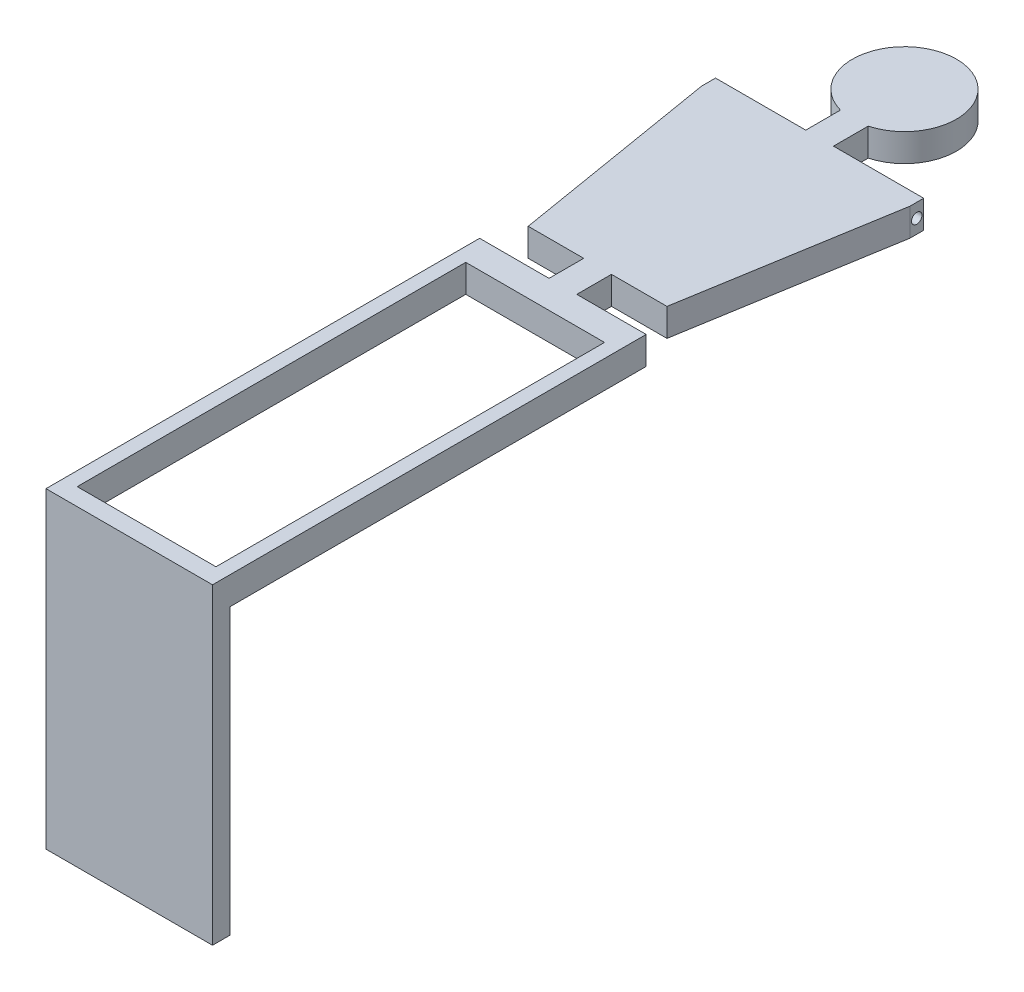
ISO-10303-21;
HEADER;
FILE_DESCRIPTION(('STEP AP214'),'2;1');
FILE_NAME('part.step','',(''),(''),'','','');
FILE_SCHEMA(('AUTOMOTIVE_DESIGN { 1 0 10303 214 1 1 1 1 }'));
ENDSEC;
DATA;
#1=APPLICATION_CONTEXT('core data for automotive mechanical design processes');
#2=APPLICATION_PROTOCOL_DEFINITION('international standard','automotive_design',2000,#1);
#3=PRODUCT_CONTEXT('',#1,'mechanical');
#4=PRODUCT('Part','Part','',(#3));
#5=PRODUCT_RELATED_PRODUCT_CATEGORY('part','',(#4));
#6=PRODUCT_DEFINITION_FORMATION('','',#4);
#7=PRODUCT_DEFINITION_CONTEXT('part definition',#1,'design');
#8=PRODUCT_DEFINITION('design','',#6,#7);
#9=PRODUCT_DEFINITION_SHAPE('','',#8);
#10=(LENGTH_UNIT() NAMED_UNIT(*) SI_UNIT(.MILLI.,.METRE.));
#11=(NAMED_UNIT(*) PLANE_ANGLE_UNIT() SI_UNIT($,.RADIAN.));
#12=(NAMED_UNIT(*) SI_UNIT($,.STERADIAN.) SOLID_ANGLE_UNIT());
#13=UNCERTAINTY_MEASURE_WITH_UNIT(LENGTH_MEASURE(1.E-05),#10,'distance_accuracy_value','');
#14=(GEOMETRIC_REPRESENTATION_CONTEXT(3) GLOBAL_UNCERTAINTY_ASSIGNED_CONTEXT((#13)) GLOBAL_UNIT_ASSIGNED_CONTEXT((#10,
#11,#12)) REPRESENTATION_CONTEXT('',''));
#15=CARTESIAN_POINT('',(0.,0.,0.));
#16=DIRECTION('',(0.,0.,1.));
#17=DIRECTION('',(1.,0.,0.));
#18=AXIS2_PLACEMENT_3D('',#15,#16,#17);
#19=CARTESIAN_POINT('',(0.,8.,0.));
#20=DIRECTION('',(-1.,0.,0.));
#21=DIRECTION('',(0.,0.,1.));
#22=AXIS2_PLACEMENT_3D('',#19,#20,#21);
#23=PLANE('',#22);
#24=DIRECTION('',(0.,0.,-1.));
#25=VECTOR('',#24,1.);
#26=CARTESIAN_POINT('',(0.,0.,0.));
#27=LINE('',#26,#25);
#28=CARTESIAN_POINT('',(0.,0.,0.));
#29=VERTEX_POINT('',#28);
#30=CARTESIAN_POINT('',(0.,0.,-120.));
#31=VERTEX_POINT('',#30);
#32=EDGE_CURVE('E221',#29,#31,#27,.T.);
#33=ORIENTED_EDGE('',*,*,#32,.T.);
#34=DIRECTION('',(0.,-1.,0.));
#35=VECTOR('',#34,1.);
#36=CARTESIAN_POINT('',(0.,8.,-120.));
#37=LINE('',#36,#35);
#38=CARTESIAN_POINT('',(0.,8.,-120.));
#39=VERTEX_POINT('',#38);
#40=EDGE_CURVE('E11',#39,#31,#37,.T.);
#41=ORIENTED_EDGE('',*,*,#40,.F.);
#42=DIRECTION('',(0.,0.,-1.));
#43=VECTOR('',#42,1.);
#44=CARTESIAN_POINT('',(0.,8.,0.));
#45=LINE('',#44,#43);
#46=CARTESIAN_POINT('',(0.,8.,5.));
#47=VERTEX_POINT('',#46);
#48=EDGE_CURVE('E137',#47,#39,#45,.T.);
#49=ORIENTED_EDGE('',*,*,#48,.F.);
#50=DIRECTION('',(0.,1.,0.));
#51=VECTOR('',#50,1.);
#52=CARTESIAN_POINT('',(0.,-82.,5.));
#53=LINE('',#52,#51);
#54=CARTESIAN_POINT('',(0.,-82.,5.));
#55=VERTEX_POINT('',#54);
#56=EDGE_CURVE('E222',#55,#47,#53,.T.);
#57=ORIENTED_EDGE('',*,*,#56,.F.);
#58=DIRECTION('',(0.,0.,-1.));
#59=VECTOR('',#58,1.);
#60=CARTESIAN_POINT('',(0.,-82.,0.));
#61=LINE('',#60,#59);
#62=CARTESIAN_POINT('',(0.,-82.,0.));
#63=VERTEX_POINT('',#62);
#64=EDGE_CURVE('E442',#55,#63,#61,.T.);
#65=ORIENTED_EDGE('',*,*,#64,.T.);
#66=DIRECTION('',(0.,1.,0.));
#67=VECTOR('',#66,1.);
#68=CARTESIAN_POINT('',(0.,-82.,0.));
#69=LINE('',#68,#67);
#70=EDGE_CURVE('E458',#63,#29,#69,.T.);
#71=ORIENTED_EDGE('',*,*,#70,.T.);
#72=EDGE_LOOP('',(#33,#41,#49,#57,#65,#71));
#73=FACE_BOUND('',#72,.T.);
#74=ADVANCED_FACE('F39',(#73),#23,.F.);
#75=CARTESIAN_POINT('',(0.,8.,-120.));
#76=DIRECTION('',(0.,0.,1.));
#77=DIRECTION('',(1.,0.,0.));
#78=AXIS2_PLACEMENT_3D('',#75,#76,#77);
#79=PLANE('',#78);
#80=DIRECTION('',(-1.,0.,0.));
#81=VECTOR('',#80,1.);
#82=CARTESIAN_POINT('',(0.,0.,-120.));
#83=LINE('',#82,#81);
#84=CARTESIAN_POINT('',(-20.,0.,-120.));
#85=VERTEX_POINT('',#84);
#86=EDGE_CURVE('E225',#31,#85,#83,.T.);
#87=ORIENTED_EDGE('',*,*,#86,.T.);
#88=DIRECTION('',(0.,-1.,0.));
#89=VECTOR('',#88,1.);
#90=CARTESIAN_POINT('',(-20.,8.,-120.));
#91=LINE('',#90,#89);
#92=CARTESIAN_POINT('',(-20.,8.,-120.));
#93=VERTEX_POINT('',#92);
#94=EDGE_CURVE('E48',#93,#85,#91,.T.);
#95=ORIENTED_EDGE('',*,*,#94,.F.);
#96=DIRECTION('',(-1.,0.,0.));
#97=VECTOR('',#96,1.);
#98=CARTESIAN_POINT('',(0.,8.,-120.));
#99=LINE('',#98,#97);
#100=EDGE_CURVE('E465',#39,#93,#99,.T.);
#101=ORIENTED_EDGE('',*,*,#100,.F.);
#102=ORIENTED_EDGE('',*,*,#40,.T.);
#103=EDGE_LOOP('',(#87,#95,#101,#102));
#104=FACE_BOUND('',#103,.T.);
#105=ADVANCED_FACE('F468',(#104),#79,.F.);
#106=CARTESIAN_POINT('',(-20.,8.,-120.));
#107=DIRECTION('',(-1.,0.,0.));
#108=DIRECTION('',(0.,0.,1.));
#109=AXIS2_PLACEMENT_3D('',#106,#107,#108);
#110=PLANE('',#109);
#111=DIRECTION('',(0.,0.,-1.));
#112=VECTOR('',#111,1.);
#113=CARTESIAN_POINT('',(-20.,0.,-120.));
#114=LINE('',#113,#112);
#115=CARTESIAN_POINT('',(-20.,0.,-130.));
#116=VERTEX_POINT('',#115);
#117=EDGE_CURVE('E228',#85,#116,#114,.T.);
#118=ORIENTED_EDGE('',*,*,#117,.T.);
#119=DIRECTION('',(0.,-1.,0.));
#120=VECTOR('',#119,1.);
#121=CARTESIAN_POINT('',(-20.,8.,-130.));
#122=LINE('',#121,#120);
#123=CARTESIAN_POINT('',(-20.,8.,-130.));
#124=VERTEX_POINT('',#123);
#125=EDGE_CURVE('E342',#124,#116,#122,.T.);
#126=ORIENTED_EDGE('',*,*,#125,.F.);
#127=DIRECTION('',(0.,0.,-1.));
#128=VECTOR('',#127,1.);
#129=CARTESIAN_POINT('',(-20.,8.,-120.));
#130=LINE('',#129,#128);
#131=EDGE_CURVE('E353',#93,#124,#130,.T.);
#132=ORIENTED_EDGE('',*,*,#131,.F.);
#133=ORIENTED_EDGE('',*,*,#94,.T.);
#134=EDGE_LOOP('',(#118,#126,#132,#133));
#135=FACE_BOUND('',#134,.T.);
#136=ADVANCED_FACE('F351',(#135),#110,.F.);
#137=CARTESIAN_POINT('',(-20.,8.,-130.));
#138=DIRECTION('',(0.,0.,-1.));
#139=DIRECTION('',(-1.,0.,0.));
#140=AXIS2_PLACEMENT_3D('',#137,#138,#139);
#141=PLANE('',#140);
#142=DIRECTION('',(1.,0.,0.));
#143=VECTOR('',#142,1.);
#144=CARTESIAN_POINT('',(-20.,0.,-130.));
#145=LINE('',#144,#143);
#146=CARTESIAN_POINT('',(-4.,0.,-130.));
#147=VERTEX_POINT('',#146);
#148=EDGE_CURVE('E231',#116,#147,#145,.T.);
#149=ORIENTED_EDGE('',*,*,#148,.T.);
#150=DIRECTION('',(0.,-1.,0.));
#151=VECTOR('',#150,1.);
#152=CARTESIAN_POINT('',(-4.,8.,-130.));
#153=LINE('',#152,#151);
#154=CARTESIAN_POINT('',(-4.,8.,-130.));
#155=VERTEX_POINT('',#154);
#156=EDGE_CURVE('E338',#155,#147,#153,.T.);
#157=ORIENTED_EDGE('',*,*,#156,.F.);
#158=DIRECTION('',(1.,0.,0.));
#159=VECTOR('',#158,1.);
#160=CARTESIAN_POINT('',(-20.,8.,-130.));
#161=LINE('',#160,#159);
#162=EDGE_CURVE('E375',#124,#155,#161,.T.);
#163=ORIENTED_EDGE('',*,*,#162,.F.);
#164=ORIENTED_EDGE('',*,*,#125,.T.);
#165=EDGE_LOOP('',(#149,#157,#163,#164));
#166=FACE_BOUND('',#165,.T.);
#167=ADVANCED_FACE('F365',(#166),#141,.F.);
#168=CARTESIAN_POINT('',(-4.,8.,-130.));
#169=DIRECTION('',(-0.986393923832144,0.,-0.164398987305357));
#170=DIRECTION('',(-0.164398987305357,0.,0.986393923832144));
#171=AXIS2_PLACEMENT_3D('',#168,#169,#170);
#172=PLANE('',#171);
#173=DIRECTION('',(0.164398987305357,0.,-0.986393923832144));
#174=VECTOR('',#173,1.);
#175=CARTESIAN_POINT('',(-4.,0.,-130.));
#176=LINE('',#175,#174);
#177=CARTESIAN_POINT('',(6.00000000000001,0.,-190.));
#178=VERTEX_POINT('',#177);
#179=EDGE_CURVE('E234',#147,#178,#176,.T.);
#180=ORIENTED_EDGE('',*,*,#179,.T.);
#181=DIRECTION('',(0.,-1.,0.));
#182=VECTOR('',#181,1.);
#183=CARTESIAN_POINT('',(6.00000000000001,8.,-190.));
#184=LINE('',#183,#182);
#185=CARTESIAN_POINT('',(6.00000000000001,8.,-190.));
#186=VERTEX_POINT('',#185);
#187=EDGE_CURVE('E334',#186,#178,#184,.T.);
#188=ORIENTED_EDGE('',*,*,#187,.F.);
#189=DIRECTION('',(0.164398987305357,0.,-0.986393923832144));
#190=VECTOR('',#189,1.);
#191=CARTESIAN_POINT('',(-4.,8.,-130.));
#192=LINE('',#191,#190);
#193=EDGE_CURVE('E371',#155,#186,#192,.T.);
#194=ORIENTED_EDGE('',*,*,#193,.F.);
#195=ORIENTED_EDGE('',*,*,#156,.T.);
#196=EDGE_LOOP('',(#180,#188,#194,#195));
#197=FACE_BOUND('',#196,.T.);
#198=ADVANCED_FACE('F369',(#197),#172,.F.);
#199=CARTESIAN_POINT('',(6.00000000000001,8.,-194.));
#200=DIRECTION('',(-1.,0.,0.));
#201=DIRECTION('',(0.,0.,1.));
#202=AXIS2_PLACEMENT_3D('',#199,#200,#201);
#203=PLANE('',#202);
#204=CARTESIAN_POINT('',(6.00000000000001,4.,-192.));
#205=DIRECTION('',(-1.,0.,0.));
#206=DIRECTION('',(0.,0.,1.));
#207=AXIS2_PLACEMENT_3D('',#204,#205,#206);
#208=CIRCLE('',#207,1.5);
#209=CARTESIAN_POINT('',(6.00000000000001,4.,-190.5));
#210=VERTEX_POINT('',#209);
#211=EDGE_CURVE('E449',#210,#210,#208,.T.);
#212=ORIENTED_EDGE('',*,*,#211,.T.);
#213=EDGE_LOOP('',(#212));
#214=FACE_BOUND('',#213,.T.);
#215=DIRECTION('',(0.,0.,-1.));
#216=VECTOR('',#215,1.);
#217=CARTESIAN_POINT('',(6.00000000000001,0.,-194.));
#218=LINE('',#217,#216);
#219=CARTESIAN_POINT('',(6.00000000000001,0.,-194.));
#220=VERTEX_POINT('',#219);
#221=EDGE_CURVE('E237',#178,#220,#218,.T.);
#222=ORIENTED_EDGE('',*,*,#221,.T.);
#223=DIRECTION('',(0.,-1.,0.));
#224=VECTOR('',#223,1.);
#225=CARTESIAN_POINT('',(6.00000000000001,8.,-194.));
#226=LINE('',#225,#224);
#227=CARTESIAN_POINT('',(6.00000000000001,8.,-194.));
#228=VERTEX_POINT('',#227);
#229=EDGE_CURVE('E330',#228,#220,#226,.T.);
#230=ORIENTED_EDGE('',*,*,#229,.F.);
#231=DIRECTION('',(0.,0.,-1.));
#232=VECTOR('',#231,1.);
#233=CARTESIAN_POINT('',(6.00000000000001,8.,-194.));
#234=LINE('',#233,#232);
#235=EDGE_CURVE('E374',#186,#228,#234,.T.);
#236=ORIENTED_EDGE('',*,*,#235,.F.);
#237=ORIENTED_EDGE('',*,*,#187,.T.);
#238=EDGE_LOOP('',(#222,#230,#236,#237));
#239=FACE_BOUND('',#238,.T.);
#240=ADVANCED_FACE('F500',(#214,#239),#203,.F.);
#241=CARTESIAN_POINT('',(-20.,8.,-194.));
#242=DIRECTION('',(0.,0.,1.));
#243=DIRECTION('',(1.,0.,0.));
#244=AXIS2_PLACEMENT_3D('',#241,#242,#243);
#245=PLANE('',#244);
#246=DIRECTION('',(-1.,0.,0.));
#247=VECTOR('',#246,1.);
#248=CARTESIAN_POINT('',(-20.,0.,-194.));
#249=LINE('',#248,#247);
#250=CARTESIAN_POINT('',(-20.,0.,-194.));
#251=VERTEX_POINT('',#250);
#252=EDGE_CURVE('E240',#220,#251,#249,.T.);
#253=ORIENTED_EDGE('',*,*,#252,.T.);
#254=DIRECTION('',(0.,-1.,0.));
#255=VECTOR('',#254,1.);
#256=CARTESIAN_POINT('',(-20.,8.,-194.));
#257=LINE('',#256,#255);
#258=CARTESIAN_POINT('',(-20.,8.,-194.));
#259=VERTEX_POINT('',#258);
#260=EDGE_CURVE('E326',#259,#251,#257,.T.);
#261=ORIENTED_EDGE('',*,*,#260,.F.);
#262=DIRECTION('',(-1.,0.,0.));
#263=VECTOR('',#262,1.);
#264=CARTESIAN_POINT('',(-20.,8.,-194.));
#265=LINE('',#264,#263);
#266=EDGE_CURVE('E379',#228,#259,#265,.T.);
#267=ORIENTED_EDGE('',*,*,#266,.F.);
#268=ORIENTED_EDGE('',*,*,#229,.T.);
#269=EDGE_LOOP('',(#253,#261,#267,#268));
#270=FACE_BOUND('',#269,.T.);
#271=ADVANCED_FACE('F555',(#270),#245,.F.);
#272=CARTESIAN_POINT('',(-20.,8.,-204.));
#273=DIRECTION('',(-1.,0.,0.));
#274=DIRECTION('',(0.,0.,1.));
#275=AXIS2_PLACEMENT_3D('',#272,#273,#274);
#276=PLANE('',#275);
#277=DIRECTION('',(0.,0.,-1.));
#278=VECTOR('',#277,1.);
#279=CARTESIAN_POINT('',(-20.,0.,-204.));
#280=LINE('',#279,#278);
#281=CARTESIAN_POINT('',(-20.,0.,-204.));
#282=VERTEX_POINT('',#281);
#283=EDGE_CURVE('E243',#251,#282,#280,.T.);
#284=ORIENTED_EDGE('',*,*,#283,.T.);
#285=DIRECTION('',(0.,-1.,0.));
#286=VECTOR('',#285,1.);
#287=CARTESIAN_POINT('',(-20.,8.,-204.));
#288=LINE('',#287,#286);
#289=CARTESIAN_POINT('',(-20.,8.,-204.));
#290=VERTEX_POINT('',#289);
#291=EDGE_CURVE('E322',#290,#282,#288,.T.);
#292=ORIENTED_EDGE('',*,*,#291,.F.);
#293=DIRECTION('',(0.,0.,-1.));
#294=VECTOR('',#293,1.);
#295=CARTESIAN_POINT('',(-20.,8.,-204.));
#296=LINE('',#295,#294);
#297=EDGE_CURVE('E386',#259,#290,#296,.T.);
#298=ORIENTED_EDGE('',*,*,#297,.F.);
#299=ORIENTED_EDGE('',*,*,#260,.T.);
#300=EDGE_LOOP('',(#284,#292,#298,#299));
#301=FACE_BOUND('',#300,.T.);
#302=ADVANCED_FACE('F551',(#301),#276,.F.);
#303=CARTESIAN_POINT('',(-24.,8.,-218.456832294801));
#304=DIRECTION('',(0.,-1.,0.));
#305=DIRECTION('',(0.,0.,-1.));
#306=AXIS2_PLACEMENT_3D('',#303,#304,#305);
#307=CYLINDRICAL_SURFACE('',#306,15.);
#308=CARTESIAN_POINT('',(-24.,0.,-218.456832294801));
#309=DIRECTION('',(0.,1.,0.));
#310=DIRECTION('',(0.,0.,-1.));
#311=AXIS2_PLACEMENT_3D('',#308,#309,#310);
#312=CIRCLE('',#311,15.);
#313=CARTESIAN_POINT('',(-28.,0.,-204.));
#314=VERTEX_POINT('',#313);
#315=EDGE_CURVE('E246',#282,#314,#312,.T.);
#316=ORIENTED_EDGE('',*,*,#315,.T.);
#317=DIRECTION('',(0.,-1.,0.));
#318=VECTOR('',#317,1.);
#319=CARTESIAN_POINT('',(-28.,8.,-204.));
#320=LINE('',#319,#318);
#321=CARTESIAN_POINT('',(-28.,8.,-204.));
#322=VERTEX_POINT('',#321);
#323=EDGE_CURVE('E318',#322,#314,#320,.T.);
#324=ORIENTED_EDGE('',*,*,#323,.F.);
#325=CARTESIAN_POINT('',(-24.,8.,-218.456832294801));
#326=DIRECTION('',(0.,1.,0.));
#327=DIRECTION('',(0.,0.,-1.));
#328=AXIS2_PLACEMENT_3D('',#325,#326,#327);
#329=CIRCLE('',#328,15.);
#330=EDGE_CURVE('E389',#290,#322,#329,.T.);
#331=ORIENTED_EDGE('',*,*,#330,.F.);
#332=ORIENTED_EDGE('',*,*,#291,.T.);
#333=EDGE_LOOP('',(#316,#324,#331,#332));
#334=FACE_BOUND('',#333,.T.);
#335=ADVANCED_FACE('F547',(#334),#307,.T.);
#336=CARTESIAN_POINT('',(-28.,8.,-194.));
#337=DIRECTION('',(1.,0.,0.));
#338=DIRECTION('',(0.,0.,-1.));
#339=AXIS2_PLACEMENT_3D('',#336,#337,#338);
#340=PLANE('',#339);
#341=DIRECTION('',(0.,0.,1.));
#342=VECTOR('',#341,1.);
#343=CARTESIAN_POINT('',(-28.,0.,-194.));
#344=LINE('',#343,#342);
#345=CARTESIAN_POINT('',(-28.,0.,-194.));
#346=VERTEX_POINT('',#345);
#347=EDGE_CURVE('E249',#314,#346,#344,.T.);
#348=ORIENTED_EDGE('',*,*,#347,.T.);
#349=DIRECTION('',(0.,-1.,0.));
#350=VECTOR('',#349,1.);
#351=CARTESIAN_POINT('',(-28.,8.,-194.));
#352=LINE('',#351,#350);
#353=CARTESIAN_POINT('',(-28.,8.,-194.));
#354=VERTEX_POINT('',#353);
#355=EDGE_CURVE('E314',#354,#346,#352,.T.);
#356=ORIENTED_EDGE('',*,*,#355,.F.);
#357=DIRECTION('',(0.,0.,1.));
#358=VECTOR('',#357,1.);
#359=CARTESIAN_POINT('',(-28.,8.,-194.));
#360=LINE('',#359,#358);
#361=EDGE_CURVE('E392',#322,#354,#360,.T.);
#362=ORIENTED_EDGE('',*,*,#361,.F.);
#363=ORIENTED_EDGE('',*,*,#323,.T.);
#364=EDGE_LOOP('',(#348,#356,#362,#363));
#365=FACE_BOUND('',#364,.T.);
#366=ADVANCED_FACE('F543',(#365),#340,.F.);
#367=CARTESIAN_POINT('',(-54.,8.,-194.));
#368=DIRECTION('',(0.,0.,1.));
#369=DIRECTION('',(1.,0.,0.));
#370=AXIS2_PLACEMENT_3D('',#367,#368,#369);
#371=PLANE('',#370);
#372=DIRECTION('',(-1.,0.,0.));
#373=VECTOR('',#372,1.);
#374=CARTESIAN_POINT('',(-54.,0.,-194.));
#375=LINE('',#374,#373);
#376=CARTESIAN_POINT('',(-54.,0.,-194.));
#377=VERTEX_POINT('',#376);
#378=EDGE_CURVE('E252',#346,#377,#375,.T.);
#379=ORIENTED_EDGE('',*,*,#378,.T.);
#380=DIRECTION('',(0.,-1.,0.));
#381=VECTOR('',#380,1.);
#382=CARTESIAN_POINT('',(-54.,8.,-194.));
#383=LINE('',#382,#381);
#384=CARTESIAN_POINT('',(-54.,8.,-194.));
#385=VERTEX_POINT('',#384);
#386=EDGE_CURVE('E310',#385,#377,#383,.T.);
#387=ORIENTED_EDGE('',*,*,#386,.F.);
#388=DIRECTION('',(-1.,0.,0.));
#389=VECTOR('',#388,1.);
#390=CARTESIAN_POINT('',(-54.,8.,-194.));
#391=LINE('',#390,#389);
#392=EDGE_CURVE('E395',#354,#385,#391,.T.);
#393=ORIENTED_EDGE('',*,*,#392,.F.);
#394=ORIENTED_EDGE('',*,*,#355,.T.);
#395=EDGE_LOOP('',(#379,#387,#393,#394));
#396=FACE_BOUND('',#395,.T.);
#397=ADVANCED_FACE('F513',(#396),#371,.F.);
#398=CARTESIAN_POINT('',(-54.,8.,-190.));
#399=DIRECTION('',(1.,0.,0.));
#400=DIRECTION('',(0.,0.,-1.));
#401=AXIS2_PLACEMENT_3D('',#398,#399,#400);
#402=PLANE('',#401);
#403=CARTESIAN_POINT('',(-54.,4.,-192.));
#404=DIRECTION('',(-1.,0.,0.));
#405=DIRECTION('',(0.,0.,1.));
#406=AXIS2_PLACEMENT_3D('',#403,#404,#405);
#407=CIRCLE('',#406,1.5);
#408=CARTESIAN_POINT('',(-54.,4.,-190.5));
#409=VERTEX_POINT('',#408);
#410=EDGE_CURVE('E492',#409,#409,#407,.T.);
#411=ORIENTED_EDGE('',*,*,#410,.F.);
#412=EDGE_LOOP('',(#411));
#413=FACE_BOUND('',#412,.T.);
#414=DIRECTION('',(0.,0.,1.));
#415=VECTOR('',#414,1.);
#416=CARTESIAN_POINT('',(-54.,0.,-190.));
#417=LINE('',#416,#415);
#418=CARTESIAN_POINT('',(-54.,0.,-190.));
#419=VERTEX_POINT('',#418);
#420=EDGE_CURVE('E255',#377,#419,#417,.T.);
#421=ORIENTED_EDGE('',*,*,#420,.T.);
#422=DIRECTION('',(0.,-1.,0.));
#423=VECTOR('',#422,1.);
#424=CARTESIAN_POINT('',(-54.,8.,-190.));
#425=LINE('',#424,#423);
#426=CARTESIAN_POINT('',(-54.,8.,-190.));
#427=VERTEX_POINT('',#426);
#428=EDGE_CURVE('E306',#427,#419,#425,.T.);
#429=ORIENTED_EDGE('',*,*,#428,.F.);
#430=DIRECTION('',(0.,0.,1.));
#431=VECTOR('',#430,1.);
#432=CARTESIAN_POINT('',(-54.,8.,-190.));
#433=LINE('',#432,#431);
#434=EDGE_CURVE('E398',#385,#427,#433,.T.);
#435=ORIENTED_EDGE('',*,*,#434,.F.);
#436=ORIENTED_EDGE('',*,*,#386,.T.);
#437=EDGE_LOOP('',(#421,#429,#435,#436));
#438=FACE_BOUND('',#437,.T.);
#439=ADVANCED_FACE('F509',(#413,#438),#402,.F.);
#440=CARTESIAN_POINT('',(-54.,8.,-190.));
#441=DIRECTION('',(0.986393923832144,0.,-0.164398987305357));
#442=DIRECTION('',(-0.164398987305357,0.,-0.986393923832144));
#443=AXIS2_PLACEMENT_3D('',#440,#441,#442);
#444=PLANE('',#443);
#445=DIRECTION('',(0.164398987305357,0.,0.986393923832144));
#446=VECTOR('',#445,1.);
#447=CARTESIAN_POINT('',(-54.,0.,-190.));
#448=LINE('',#447,#446);
#449=CARTESIAN_POINT('',(-44.,0.,-130.));
#450=VERTEX_POINT('',#449);
#451=EDGE_CURVE('E258',#419,#450,#448,.T.);
#452=ORIENTED_EDGE('',*,*,#451,.T.);
#453=DIRECTION('',(0.,-1.,0.));
#454=VECTOR('',#453,1.);
#455=CARTESIAN_POINT('',(-44.,8.,-130.));
#456=LINE('',#455,#454);
#457=CARTESIAN_POINT('',(-44.,8.,-130.));
#458=VERTEX_POINT('',#457);
#459=EDGE_CURVE('E302',#458,#450,#456,.T.);
#460=ORIENTED_EDGE('',*,*,#459,.F.);
#461=DIRECTION('',(0.164398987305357,0.,0.986393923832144));
#462=VECTOR('',#461,1.);
#463=CARTESIAN_POINT('',(-54.,8.,-190.));
#464=LINE('',#463,#462);
#465=EDGE_CURVE('E401',#427,#458,#464,.T.);
#466=ORIENTED_EDGE('',*,*,#465,.F.);
#467=ORIENTED_EDGE('',*,*,#428,.T.);
#468=EDGE_LOOP('',(#452,#460,#466,#467));
#469=FACE_BOUND('',#468,.T.);
#470=ADVANCED_FACE('F512',(#469),#444,.F.);
#471=CARTESIAN_POINT('',(-44.,8.,-130.));
#472=DIRECTION('',(0.,0.,-1.));
#473=DIRECTION('',(-1.,0.,0.));
#474=AXIS2_PLACEMENT_3D('',#471,#472,#473);
#475=PLANE('',#474);
#476=DIRECTION('',(1.,0.,0.));
#477=VECTOR('',#476,1.);
#478=CARTESIAN_POINT('',(-44.,0.,-130.));
#479=LINE('',#478,#477);
#480=CARTESIAN_POINT('',(-28.,0.,-130.));
#481=VERTEX_POINT('',#480);
#482=EDGE_CURVE('E261',#450,#481,#479,.T.);
#483=ORIENTED_EDGE('',*,*,#482,.T.);
#484=DIRECTION('',(0.,-1.,0.));
#485=VECTOR('',#484,1.);
#486=CARTESIAN_POINT('',(-28.,8.,-130.));
#487=LINE('',#486,#485);
#488=CARTESIAN_POINT('',(-28.,8.,-130.));
#489=VERTEX_POINT('',#488);
#490=EDGE_CURVE('E298',#489,#481,#487,.T.);
#491=ORIENTED_EDGE('',*,*,#490,.F.);
#492=DIRECTION('',(1.,0.,0.));
#493=VECTOR('',#492,1.);
#494=CARTESIAN_POINT('',(-44.,8.,-130.));
#495=LINE('',#494,#493);
#496=EDGE_CURVE('E404',#458,#489,#495,.T.);
#497=ORIENTED_EDGE('',*,*,#496,.F.);
#498=ORIENTED_EDGE('',*,*,#459,.T.);
#499=EDGE_LOOP('',(#483,#491,#497,#498));
#500=FACE_BOUND('',#499,.T.);
#501=ADVANCED_FACE('F529',(#500),#475,.F.);
#502=CARTESIAN_POINT('',(-28.,8.,-130.));
#503=DIRECTION('',(1.,0.,0.));
#504=DIRECTION('',(0.,0.,-1.));
#505=AXIS2_PLACEMENT_3D('',#502,#503,#504);
#506=PLANE('',#505);
#507=DIRECTION('',(0.,0.,1.));
#508=VECTOR('',#507,1.);
#509=CARTESIAN_POINT('',(-28.,0.,-130.));
#510=LINE('',#509,#508);
#511=CARTESIAN_POINT('',(-28.,0.,-120.));
#512=VERTEX_POINT('',#511);
#513=EDGE_CURVE('E264',#481,#512,#510,.T.);
#514=ORIENTED_EDGE('',*,*,#513,.T.);
#515=DIRECTION('',(0.,-1.,0.));
#516=VECTOR('',#515,1.);
#517=CARTESIAN_POINT('',(-28.,8.,-120.));
#518=LINE('',#517,#516);
#519=CARTESIAN_POINT('',(-28.,8.,-120.));
#520=VERTEX_POINT('',#519);
#521=EDGE_CURVE('E294',#520,#512,#518,.T.);
#522=ORIENTED_EDGE('',*,*,#521,.F.);
#523=DIRECTION('',(0.,0.,1.));
#524=VECTOR('',#523,1.);
#525=CARTESIAN_POINT('',(-28.,8.,-130.));
#526=LINE('',#525,#524);
#527=EDGE_CURVE('E407',#489,#520,#526,.T.);
#528=ORIENTED_EDGE('',*,*,#527,.F.);
#529=ORIENTED_EDGE('',*,*,#490,.T.);
#530=EDGE_LOOP('',(#514,#522,#528,#529));
#531=FACE_BOUND('',#530,.T.);
#532=ADVANCED_FACE('F533',(#531),#506,.F.);
#533=CARTESIAN_POINT('',(-28.,8.,-120.));
#534=DIRECTION('',(0.,0.,1.));
#535=DIRECTION('',(1.,0.,0.));
#536=AXIS2_PLACEMENT_3D('',#533,#534,#535);
#537=PLANE('',#536);
#538=DIRECTION('',(-1.,0.,0.));
#539=VECTOR('',#538,1.);
#540=CARTESIAN_POINT('',(-28.,0.,-120.));
#541=LINE('',#540,#539);
#542=CARTESIAN_POINT('',(-48.,0.,-120.));
#543=VERTEX_POINT('',#542);
#544=EDGE_CURVE('E267',#512,#543,#541,.T.);
#545=ORIENTED_EDGE('',*,*,#544,.T.);
#546=DIRECTION('',(0.,-1.,0.));
#547=VECTOR('',#546,1.);
#548=CARTESIAN_POINT('',(-48.,8.,-120.));
#549=LINE('',#548,#547);
#550=CARTESIAN_POINT('',(-48.,8.,-120.));
#551=VERTEX_POINT('',#550);
#552=EDGE_CURVE('E290',#551,#543,#549,.T.);
#553=ORIENTED_EDGE('',*,*,#552,.F.);
#554=DIRECTION('',(-1.,0.,0.));
#555=VECTOR('',#554,1.);
#556=CARTESIAN_POINT('',(-28.,8.,-120.));
#557=LINE('',#556,#555);
#558=EDGE_CURVE('E410',#520,#551,#557,.T.);
#559=ORIENTED_EDGE('',*,*,#558,.F.);
#560=ORIENTED_EDGE('',*,*,#521,.T.);
#561=EDGE_LOOP('',(#545,#553,#559,#560));
#562=FACE_BOUND('',#561,.T.);
#563=ADVANCED_FACE('F644',(#562),#537,.F.);
#564=CARTESIAN_POINT('',(-48.,8.,-120.));
#565=DIRECTION('',(1.,0.,0.));
#566=DIRECTION('',(0.,0.,-1.));
#567=AXIS2_PLACEMENT_3D('',#564,#565,#566);
#568=PLANE('',#567);
#569=DIRECTION('',(0.,0.,1.));
#570=VECTOR('',#569,1.);
#571=CARTESIAN_POINT('',(-48.,0.,-120.));
#572=LINE('',#571,#570);
#573=CARTESIAN_POINT('',(-48.,0.,0.));
#574=VERTEX_POINT('',#573);
#575=EDGE_CURVE('E270',#543,#574,#572,.T.);
#576=ORIENTED_EDGE('',*,*,#575,.T.);
#577=DIRECTION('',(0.,1.,0.));
#578=VECTOR('',#577,1.);
#579=CARTESIAN_POINT('',(-48.,-82.,0.));
#580=LINE('',#579,#578);
#581=CARTESIAN_POINT('',(-48.,-82.,0.));
#582=VERTEX_POINT('',#581);
#583=EDGE_CURVE('E436',#582,#574,#580,.T.);
#584=ORIENTED_EDGE('',*,*,#583,.F.);
#585=DIRECTION('',(0.,0.,1.));
#586=VECTOR('',#585,1.);
#587=CARTESIAN_POINT('',(-48.,-82.,0.));
#588=LINE('',#587,#586);
#589=CARTESIAN_POINT('',(-48.,-82.,5.00000000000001));
#590=VERTEX_POINT('',#589);
#591=EDGE_CURVE('E431',#582,#590,#588,.T.);
#592=ORIENTED_EDGE('',*,*,#591,.T.);
#593=DIRECTION('',(0.,1.,0.));
#594=VECTOR('',#593,1.);
#595=CARTESIAN_POINT('',(-48.,-82.,5.00000000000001));
#596=LINE('',#595,#594);
#597=CARTESIAN_POINT('',(-48.,8.,5.00000000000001));
#598=VERTEX_POINT('',#597);
#599=EDGE_CURVE('E426',#590,#598,#596,.T.);
#600=ORIENTED_EDGE('',*,*,#599,.T.);
#601=DIRECTION('',(0.,0.,1.));
#602=VECTOR('',#601,1.);
#603=CARTESIAN_POINT('',(-48.,8.,-120.));
#604=LINE('',#603,#602);
#605=EDGE_CURVE('E199',#551,#598,#604,.T.);
#606=ORIENTED_EDGE('',*,*,#605,.F.);
#607=ORIENTED_EDGE('',*,*,#552,.T.);
#608=EDGE_LOOP('',(#576,#584,#592,#600,#606,#607));
#609=FACE_BOUND('',#608,.T.);
#610=ADVANCED_FACE('F427',(#609),#568,.F.);
#611=CARTESIAN_POINT('',(-44.,8.,0.));
#612=DIRECTION('',(-1.,0.,0.));
#613=DIRECTION('',(0.,0.,1.));
#614=AXIS2_PLACEMENT_3D('',#611,#612,#613);
#615=PLANE('',#614);
#616=DIRECTION('',(0.,0.,-1.));
#617=VECTOR('',#616,1.);
#618=CARTESIAN_POINT('',(-44.,0.,0.));
#619=LINE('',#618,#617);
#620=CARTESIAN_POINT('',(-44.,0.,0.));
#621=VERTEX_POINT('',#620);
#622=CARTESIAN_POINT('',(-44.,0.,-112.));
#623=VERTEX_POINT('',#622);
#624=EDGE_CURVE('E204',#621,#623,#619,.T.);
#625=ORIENTED_EDGE('',*,*,#624,.T.);
#626=DIRECTION('',(0.,-1.,0.));
#627=VECTOR('',#626,1.);
#628=CARTESIAN_POINT('',(-44.,8.,-112.));
#629=LINE('',#628,#627);
#630=CARTESIAN_POINT('',(-44.,8.,-112.));
#631=VERTEX_POINT('',#630);
#632=EDGE_CURVE('E201',#631,#623,#629,.T.);
#633=ORIENTED_EDGE('',*,*,#632,.F.);
#634=DIRECTION('',(0.,0.,-1.));
#635=VECTOR('',#634,1.);
#636=CARTESIAN_POINT('',(-44.,8.,0.));
#637=LINE('',#636,#635);
#638=CARTESIAN_POINT('',(-44.,8.,0.));
#639=VERTEX_POINT('',#638);
#640=EDGE_CURVE('E188',#639,#631,#637,.T.);
#641=ORIENTED_EDGE('',*,*,#640,.F.);
#642=DIRECTION('',(0.,-1.,0.));
#643=VECTOR('',#642,1.);
#644=CARTESIAN_POINT('',(-44.,8.,0.));
#645=LINE('',#644,#643);
#646=EDGE_CURVE('E206',#639,#621,#645,.T.);
#647=ORIENTED_EDGE('',*,*,#646,.T.);
#648=EDGE_LOOP('',(#625,#633,#641,#647));
#649=FACE_BOUND('',#648,.T.);
#650=ADVANCED_FACE('F202',(#649),#615,.F.);
#651=CARTESIAN_POINT('',(-44.,8.,-112.));
#652=DIRECTION('',(0.,0.,-1.));
#653=DIRECTION('',(-1.,0.,0.));
#654=AXIS2_PLACEMENT_3D('',#651,#652,#653);
#655=PLANE('',#654);
#656=DIRECTION('',(1.,0.,0.));
#657=VECTOR('',#656,1.);
#658=CARTESIAN_POINT('',(-44.,0.,-112.));
#659=LINE('',#658,#657);
#660=CARTESIAN_POINT('',(-4.,0.,-112.));
#661=VERTEX_POINT('',#660);
#662=EDGE_CURVE('E122',#623,#661,#659,.T.);
#663=ORIENTED_EDGE('',*,*,#662,.T.);
#664=DIRECTION('',(0.,-1.,0.));
#665=VECTOR('',#664,1.);
#666=CARTESIAN_POINT('',(-4.,8.,-112.));
#667=LINE('',#666,#665);
#668=CARTESIAN_POINT('',(-4.,8.,-112.));
#669=VERTEX_POINT('',#668);
#670=EDGE_CURVE('E207',#669,#661,#667,.T.);
#671=ORIENTED_EDGE('',*,*,#670,.F.);
#672=DIRECTION('',(1.,0.,0.));
#673=VECTOR('',#672,1.);
#674=CARTESIAN_POINT('',(-44.,8.,-112.));
#675=LINE('',#674,#673);
#676=EDGE_CURVE('E192',#631,#669,#675,.T.);
#677=ORIENTED_EDGE('',*,*,#676,.F.);
#678=ORIENTED_EDGE('',*,*,#632,.T.);
#679=EDGE_LOOP('',(#663,#671,#677,#678));
#680=FACE_BOUND('',#679,.T.);
#681=ADVANCED_FACE('F209',(#680),#655,.F.);
#682=CARTESIAN_POINT('',(-4.,8.,-112.));
#683=DIRECTION('',(1.,0.,0.));
#684=DIRECTION('',(0.,0.,-1.));
#685=AXIS2_PLACEMENT_3D('',#682,#683,#684);
#686=PLANE('',#685);
#687=DIRECTION('',(0.,0.,1.));
#688=VECTOR('',#687,1.);
#689=CARTESIAN_POINT('',(-4.,0.,-112.));
#690=LINE('',#689,#688);
#691=CARTESIAN_POINT('',(-3.99999999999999,0.,0.));
#692=VERTEX_POINT('',#691);
#693=EDGE_CURVE('E128',#661,#692,#690,.T.);
#694=ORIENTED_EDGE('',*,*,#693,.T.);
#695=DIRECTION('',(0.,-1.,0.));
#696=VECTOR('',#695,1.);
#697=CARTESIAN_POINT('',(-3.99999999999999,8.,0.));
#698=LINE('',#697,#696);
#699=CARTESIAN_POINT('',(-3.99999999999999,8.,0.));
#700=VERTEX_POINT('',#699);
#701=EDGE_CURVE('E213',#700,#692,#698,.T.);
#702=ORIENTED_EDGE('',*,*,#701,.F.);
#703=DIRECTION('',(0.,0.,1.));
#704=VECTOR('',#703,1.);
#705=CARTESIAN_POINT('',(-4.,8.,-112.));
#706=LINE('',#705,#704);
#707=EDGE_CURVE('E56',#669,#700,#706,.T.);
#708=ORIENTED_EDGE('',*,*,#707,.F.);
#709=ORIENTED_EDGE('',*,*,#670,.T.);
#710=EDGE_LOOP('',(#694,#702,#708,#709));
#711=FACE_BOUND('',#710,.T.);
#712=ADVANCED_FACE('F478',(#711),#686,.F.);
#713=CARTESIAN_POINT('',(-24.,8.,-218.456832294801));
#714=DIRECTION('',(0.,-1.,0.));
#715=DIRECTION('',(0.,0.,-1.));
#716=AXIS2_PLACEMENT_3D('',#713,#714,#715);
#717=PLANE('',#716);
#718=DIRECTION('',(-1.,0.,0.));
#719=VECTOR('',#718,1.);
#720=CARTESIAN_POINT('',(0.,8.,0.));
#721=LINE('',#720,#719);
#722=EDGE_CURVE('E194',#700,#639,#721,.T.);
#723=ORIENTED_EDGE('',*,*,#722,.T.);
#724=ORIENTED_EDGE('',*,*,#640,.T.);
#725=ORIENTED_EDGE('',*,*,#676,.T.);
#726=ORIENTED_EDGE('',*,*,#707,.T.);
#727=EDGE_LOOP('',(#723,#724,#725,#726));
#728=FACE_BOUND('',#727,.T.);
#729=ORIENTED_EDGE('',*,*,#605,.T.);
#730=DIRECTION('',(1.,0.,0.));
#731=VECTOR('',#730,1.);
#732=CARTESIAN_POINT('',(0.,8.,5.));
#733=LINE('',#732,#731);
#734=EDGE_CURVE('E419',#598,#47,#733,.T.);
#735=ORIENTED_EDGE('',*,*,#734,.T.);
#736=ORIENTED_EDGE('',*,*,#48,.T.);
#737=ORIENTED_EDGE('',*,*,#100,.T.);
#738=ORIENTED_EDGE('',*,*,#131,.T.);
#739=ORIENTED_EDGE('',*,*,#162,.T.);
#740=ORIENTED_EDGE('',*,*,#193,.T.);
#741=ORIENTED_EDGE('',*,*,#235,.T.);
#742=ORIENTED_EDGE('',*,*,#266,.T.);
#743=ORIENTED_EDGE('',*,*,#297,.T.);
#744=ORIENTED_EDGE('',*,*,#330,.T.);
#745=ORIENTED_EDGE('',*,*,#361,.T.);
#746=ORIENTED_EDGE('',*,*,#392,.T.);
#747=ORIENTED_EDGE('',*,*,#434,.T.);
#748=ORIENTED_EDGE('',*,*,#465,.T.);
#749=ORIENTED_EDGE('',*,*,#496,.T.);
#750=ORIENTED_EDGE('',*,*,#527,.T.);
#751=ORIENTED_EDGE('',*,*,#558,.T.);
#752=EDGE_LOOP('',(#729,#735,#736,#737,#738,#739,#740,#741,#742,#743,#744,#745,#746,#747,#748,
#749,#750,#751));
#753=FACE_BOUND('',#752,.T.);
#754=ADVANCED_FACE('F190',(#728,#753),#717,.F.);
#755=CARTESIAN_POINT('',(-24.,0.,-218.456832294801));
#756=DIRECTION('',(0.,-1.,0.));
#757=DIRECTION('',(0.,0.,-1.));
#758=AXIS2_PLACEMENT_3D('',#755,#756,#757);
#759=PLANE('',#758);
#760=DIRECTION('',(1.,0.,0.));
#761=VECTOR('',#760,1.);
#762=CARTESIAN_POINT('',(-3.99999999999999,0.,0.));
#763=LINE('',#762,#761);
#764=EDGE_CURVE('E217',#692,#29,#763,.T.);
#765=ORIENTED_EDGE('',*,*,#764,.F.);
#766=ORIENTED_EDGE('',*,*,#693,.F.);
#767=ORIENTED_EDGE('',*,*,#662,.F.);
#768=ORIENTED_EDGE('',*,*,#624,.F.);
#769=DIRECTION('',(1.,0.,0.));
#770=VECTOR('',#769,1.);
#771=CARTESIAN_POINT('',(-48.,0.,0.));
#772=LINE('',#771,#770);
#773=EDGE_CURVE('E273',#574,#621,#772,.T.);
#774=ORIENTED_EDGE('',*,*,#773,.F.);
#775=ORIENTED_EDGE('',*,*,#575,.F.);
#776=ORIENTED_EDGE('',*,*,#544,.F.);
#777=ORIENTED_EDGE('',*,*,#513,.F.);
#778=ORIENTED_EDGE('',*,*,#482,.F.);
#779=ORIENTED_EDGE('',*,*,#451,.F.);
#780=ORIENTED_EDGE('',*,*,#420,.F.);
#781=ORIENTED_EDGE('',*,*,#378,.F.);
#782=ORIENTED_EDGE('',*,*,#347,.F.);
#783=ORIENTED_EDGE('',*,*,#315,.F.);
#784=ORIENTED_EDGE('',*,*,#283,.F.);
#785=ORIENTED_EDGE('',*,*,#252,.F.);
#786=ORIENTED_EDGE('',*,*,#221,.F.);
#787=ORIENTED_EDGE('',*,*,#179,.F.);
#788=ORIENTED_EDGE('',*,*,#148,.F.);
#789=ORIENTED_EDGE('',*,*,#117,.F.);
#790=ORIENTED_EDGE('',*,*,#86,.F.);
#791=ORIENTED_EDGE('',*,*,#32,.F.);
#792=EDGE_LOOP('',(#765,#766,#767,#768,#774,#775,#776,#777,#778,#779,#780,#781,#782,#783,#784,
#785,#786,#787,#788,#789,#790,#791));
#793=FACE_BOUND('',#792,.T.);
#794=ADVANCED_FACE('F359',(#793),#759,.T.);
#795=CARTESIAN_POINT('',(0.,-82.,0.));
#796=DIRECTION('',(0.,0.,-1.));
#797=DIRECTION('',(-1.,0.,0.));
#798=AXIS2_PLACEMENT_3D('',#795,#796,#797);
#799=PLANE('',#798);
#800=ORIENTED_EDGE('',*,*,#646,.F.);
#801=ORIENTED_EDGE('',*,*,#722,.F.);
#802=ORIENTED_EDGE('',*,*,#701,.T.);
#803=ORIENTED_EDGE('',*,*,#764,.T.);
#804=ORIENTED_EDGE('',*,*,#70,.F.);
#805=DIRECTION('',(-1.,0.,0.));
#806=VECTOR('',#805,1.);
#807=CARTESIAN_POINT('',(0.,-82.,0.));
#808=LINE('',#807,#806);
#809=EDGE_CURVE('E447',#63,#582,#808,.T.);
#810=ORIENTED_EDGE('',*,*,#809,.T.);
#811=ORIENTED_EDGE('',*,*,#583,.T.);
#812=ORIENTED_EDGE('',*,*,#773,.T.);
#813=EDGE_LOOP('',(#800,#801,#802,#803,#804,#810,#811,#812));
#814=FACE_BOUND('',#813,.T.);
#815=ADVANCED_FACE('F474',(#814),#799,.T.);
#816=CARTESIAN_POINT('',(0.,-82.,5.));
#817=DIRECTION('',(0.,0.,1.));
#818=DIRECTION('',(1.,0.,0.));
#819=AXIS2_PLACEMENT_3D('',#816,#817,#818);
#820=PLANE('',#819);
#821=ORIENTED_EDGE('',*,*,#734,.F.);
#822=ORIENTED_EDGE('',*,*,#599,.F.);
#823=DIRECTION('',(1.,0.,0.));
#824=VECTOR('',#823,1.);
#825=CARTESIAN_POINT('',(0.,-82.,5.));
#826=LINE('',#825,#824);
#827=EDGE_CURVE('E462',#590,#55,#826,.T.);
#828=ORIENTED_EDGE('',*,*,#827,.T.);
#829=ORIENTED_EDGE('',*,*,#56,.T.);
#830=EDGE_LOOP('',(#821,#822,#828,#829));
#831=FACE_BOUND('',#830,.T.);
#832=ADVANCED_FACE('F439',(#831),#820,.T.);
#833=CARTESIAN_POINT('',(0.,-82.,0.));
#834=DIRECTION('',(0.,-1.,0.));
#835=DIRECTION('',(0.,0.,-1.));
#836=AXIS2_PLACEMENT_3D('',#833,#834,#835);
#837=PLANE('',#836);
#838=ORIENTED_EDGE('',*,*,#64,.F.);
#839=ORIENTED_EDGE('',*,*,#827,.F.);
#840=ORIENTED_EDGE('',*,*,#591,.F.);
#841=ORIENTED_EDGE('',*,*,#809,.F.);
#842=EDGE_LOOP('',(#838,#839,#840,#841));
#843=FACE_BOUND('',#842,.T.);
#844=ADVANCED_FACE('F485',(#843),#837,.T.);
#845=CARTESIAN_POINT('',(6.00000000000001,4.,-192.));
#846=DIRECTION('',(-1.,0.,0.));
#847=DIRECTION('',(0.,0.,1.));
#848=AXIS2_PLACEMENT_3D('',#845,#846,#847);
#849=CYLINDRICAL_SURFACE('',#848,1.5);
#850=ORIENTED_EDGE('',*,*,#211,.F.);
#851=EDGE_LOOP('',(#850));
#852=FACE_BOUND('',#851,.T.);
#853=ORIENTED_EDGE('',*,*,#410,.T.);
#854=EDGE_LOOP('',(#853));
#855=FACE_BOUND('',#854,.T.);
#856=ADVANCED_FACE('F503',(#852,#855),#849,.F.);
#857=CLOSED_SHELL('',(#74,#105,#136,#167,#198,#240,#271,#302,#335,#366,#397,#439,#470,#501,#532,
#563,#610,#650,#681,#712,#754,#794,#815,#832,#844,#856));
#858=MANIFOLD_SOLID_BREP('B2',#857);
#859=ADVANCED_BREP_SHAPE_REPRESENTATION('',(#18,#858),#14);
#860=SHAPE_DEFINITION_REPRESENTATION(#9,#859);
ENDSEC;
END-ISO-10303-21;
